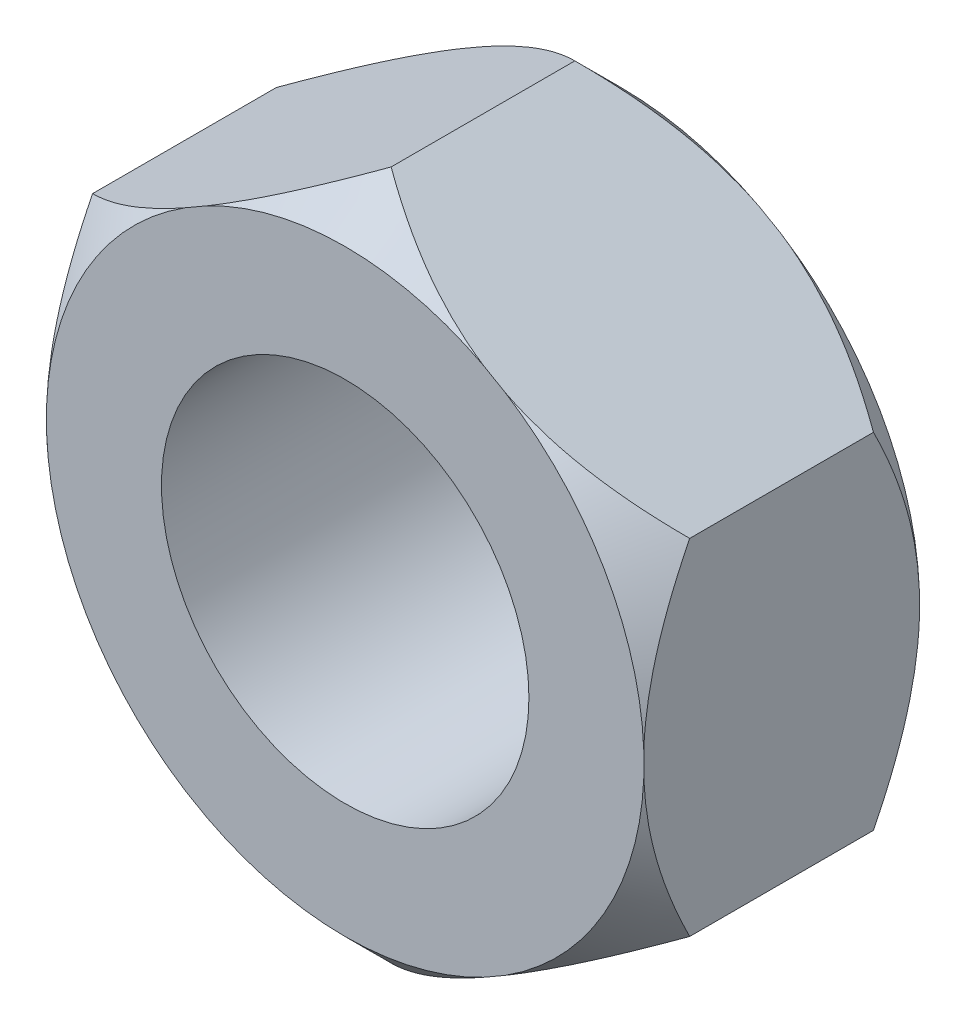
from build123d import *

# Parameters (mm, degrees)
ESQUISSE1_R          = 4
BASE_EXTRUSION_DEPTH = 6


with BuildPart() as part:
    # Esquisse1 → Base-Extrusion (new body)
    with BuildSketch(Plane.XY):
        Polygon((0, 7.505553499), (-6.5, 3.75277675), (-6.5, -3.75277675), (0, -7.505553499), (6.5, -3.75277675), (6.5, 3.75277675), align=None)
        Circle(ESQUISSE1_R, mode=Mode.SUBTRACT)
    extrude(amount=-BASE_EXTRUSION_DEPTH)

    # Esquisse2 → Enl_vement de mati_re-R_volution1 (revolve, cut)
    with BuildSketch(Plane(origin=(0, 0, 0), x_dir=(0, 0, -1), z_dir=(1, 0, 0))):
        Polygon((0, 7.505553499), (1, 7.505553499), (0, 6.505553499), align=None)
        Polygon((6, 7.505553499), (5, 7.505553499), (6, 6.505553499), align=None)
    revolve(axis=Axis((0, 0, 0), (0, 0, -1)), mode=Mode.SUBTRACT)


solid = part.part
